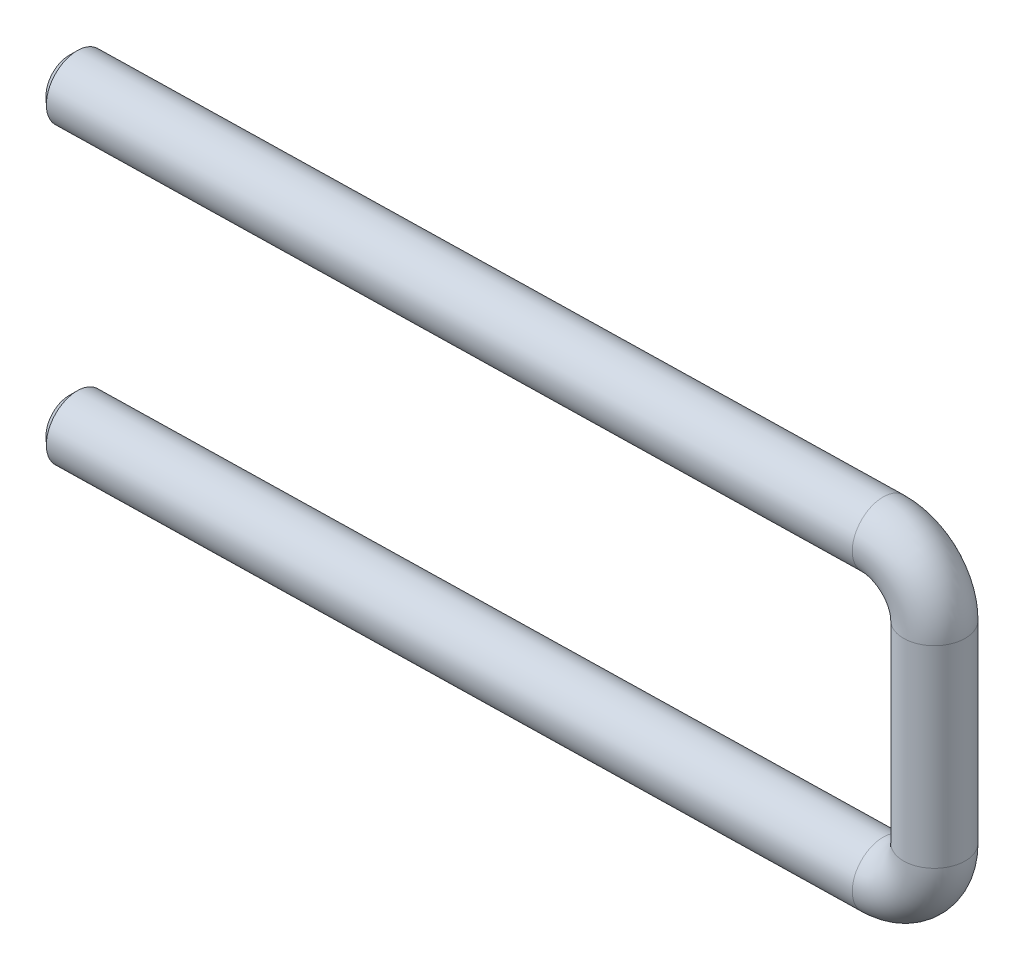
ISO-10303-21;
HEADER;
FILE_DESCRIPTION(('STEP AP214'),'2;1');
FILE_NAME('part.step','',(''),(''),'','','');
FILE_SCHEMA(('AUTOMOTIVE_DESIGN { 1 0 10303 214 1 1 1 1 }'));
ENDSEC;
DATA;
#1=APPLICATION_CONTEXT('core data for automotive mechanical design processes');
#2=APPLICATION_PROTOCOL_DEFINITION('international standard','automotive_design',2000,#1);
#3=PRODUCT_CONTEXT('',#1,'mechanical');
#4=PRODUCT('Part','Part','',(#3));
#5=PRODUCT_RELATED_PRODUCT_CATEGORY('part','',(#4));
#6=PRODUCT_DEFINITION_FORMATION('','',#4);
#7=PRODUCT_DEFINITION_CONTEXT('part definition',#1,'design');
#8=PRODUCT_DEFINITION('design','',#6,#7);
#9=PRODUCT_DEFINITION_SHAPE('','',#8);
#10=(LENGTH_UNIT() NAMED_UNIT(*) SI_UNIT(.MILLI.,.METRE.));
#11=(NAMED_UNIT(*) PLANE_ANGLE_UNIT() SI_UNIT($,.RADIAN.));
#12=(NAMED_UNIT(*) SI_UNIT($,.STERADIAN.) SOLID_ANGLE_UNIT());
#13=UNCERTAINTY_MEASURE_WITH_UNIT(LENGTH_MEASURE(1.E-05),#10,'distance_accuracy_value','');
#14=(GEOMETRIC_REPRESENTATION_CONTEXT(3) GLOBAL_UNCERTAINTY_ASSIGNED_CONTEXT((#13)) GLOBAL_UNIT_ASSIGNED_CONTEXT((#10,
#11,#12)) REPRESENTATION_CONTEXT('',''));
#15=CARTESIAN_POINT('',(0.,0.,0.));
#16=DIRECTION('',(0.,0.,1.));
#17=DIRECTION('',(1.,0.,0.));
#18=AXIS2_PLACEMENT_3D('',#15,#16,#17);
#19=CARTESIAN_POINT('',(-54.9881774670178,-9.55,1.14032401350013));
#20=DIRECTION('',(-0.999785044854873,0.,0.0207331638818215));
#21=DIRECTION('',(0.,1.,0.));
#22=AXIS2_PLACEMENT_3D('',#19,#20,#21);
#23=PLANE('',#22);
#24=CARTESIAN_POINT('',(-54.9881774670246,-9.55,1.14032401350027));
#25=DIRECTION('',(0.999785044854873,0.,-0.0207331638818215));
#26=DIRECTION('',(0.,-1.,0.));
#27=AXIS2_PLACEMENT_3D('',#24,#25,#26);
#28=CIRCLE('',#27,1.49999999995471);
#29=CARTESIAN_POINT('',(-54.9881774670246,-11.0499999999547,1.14032401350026));
#30=VERTEX_POINT('',#29);
#31=EDGE_CURVE('E15',#30,#30,#28,.T.);
#32=ORIENTED_EDGE('',*,*,#31,.F.);
#33=EDGE_LOOP('',(#32));
#34=FACE_BOUND('',#33,.T.);
#35=ADVANCED_FACE('F12',(#34),#23,.T.);
#36=CARTESIAN_POINT('',(-54.4882849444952,-9.55,1.12995743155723));
#37=DIRECTION('',(0.999785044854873,0.,-0.0207331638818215));
#38=DIRECTION('',(0.,-1.,0.));
#39=AXIS2_PLACEMENT_3D('',#36,#37,#38);
#40=CONICAL_SURFACE('',#39,2.00000000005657,0.785398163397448);
#41=CARTESIAN_POINT('',(-54.4882849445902,-9.55,1.12995743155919));
#42=DIRECTION('',(-0.999785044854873,0.,0.0207331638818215));
#43=DIRECTION('',(0.,1.,0.));
#44=AXIS2_PLACEMENT_3D('',#41,#42,#43);
#45=CIRCLE('',#44,2.);
#46=CARTESIAN_POINT('',(-54.4882849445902,-7.55,1.1299574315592));
#47=VERTEX_POINT('',#46);
#48=EDGE_CURVE('E59',#47,#47,#45,.F.);
#49=ORIENTED_EDGE('',*,*,#48,.F.);
#50=EDGE_LOOP('',(#49));
#51=FACE_BOUND('',#50,.T.);
#52=ORIENTED_EDGE('',*,*,#31,.T.);
#53=EDGE_LOOP('',(#52));
#54=FACE_BOUND('',#53,.T.);
#55=ADVANCED_FACE('F114',(#51,#54),#40,.T.);
#56=CARTESIAN_POINT('',(-3.29929064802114,-9.55,0.0684194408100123));
#57=DIRECTION('',(-0.999785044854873,0.,0.0207331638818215));
#58=DIRECTION('',(0.,1.,0.));
#59=AXIS2_PLACEMENT_3D('',#56,#57,#58);
#60=CYLINDRICAL_SURFACE('',#59,2.);
#61=ORIENTED_EDGE('',*,*,#48,.T.);
#62=EDGE_LOOP('',(#61));
#63=FACE_BOUND('',#62,.T.);
#64=CARTESIAN_POINT('',(-3.29929064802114,-9.55,0.0684194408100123));
#65=DIRECTION('',(-0.999785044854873,0.,0.0207331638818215));
#66=DIRECTION('',(0.,-1.,0.));
#67=AXIS2_PLACEMENT_3D('',#64,#65,#66);
#68=CIRCLE('',#67,2.);
#69=CARTESIAN_POINT('',(-3.29929064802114,-11.55,0.0684194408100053));
#70=VERTEX_POINT('',#69);
#71=EDGE_CURVE('E56',#70,#70,#68,.F.);
#72=ORIENTED_EDGE('',*,*,#71,.F.);
#73=EDGE_LOOP('',(#72));
#74=FACE_BOUND('',#73,.T.);
#75=ADVANCED_FACE('F51',(#63,#74),#60,.T.);
#76=CARTESIAN_POINT('',(-3.29929064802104,-6.25,0.0684194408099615));
#77=DIRECTION('',(-0.0207331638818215,0.,-0.999785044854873));
#78=DIRECTION('',(0.999785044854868,0.,-0.0207331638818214));
#79=AXIS2_PLACEMENT_3D('',#76,#77,#78);
#80=TOROIDAL_SURFACE('',#79,3.30000000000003,2.);
#81=ORIENTED_EDGE('',*,*,#71,.T.);
#82=EDGE_LOOP('',(#81));
#83=FACE_BOUND('',#82,.T.);
#84=CARTESIAN_POINT('',(0.,-6.25,0.));
#85=DIRECTION('',(0.,-1.,0.));
#86=DIRECTION('',(-0.999785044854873,0.,0.0207331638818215));
#87=AXIS2_PLACEMENT_3D('',#84,#85,#86);
#88=CIRCLE('',#87,2.);
#89=CARTESIAN_POINT('',(-1.99957008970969,-6.25,0.0414663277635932));
#90=VERTEX_POINT('',#89);
#91=EDGE_CURVE('E55',#90,#90,#88,.F.);
#92=ORIENTED_EDGE('',*,*,#91,.F.);
#93=EDGE_LOOP('',(#92));
#94=FACE_BOUND('',#93,.T.);
#95=ADVANCED_FACE('F46',(#83,#94),#80,.T.);
#96=CARTESIAN_POINT('',(0.,6.25000000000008,0.));
#97=DIRECTION('',(0.,-1.,0.));
#98=DIRECTION('',(-0.999785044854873,0.,0.0207331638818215));
#99=AXIS2_PLACEMENT_3D('',#96,#97,#98);
#100=CYLINDRICAL_SURFACE('',#99,2.);
#101=ORIENTED_EDGE('',*,*,#91,.T.);
#102=EDGE_LOOP('',(#101));
#103=FACE_BOUND('',#102,.T.);
#104=CARTESIAN_POINT('',(0.,6.25000000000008,0.));
#105=DIRECTION('',(0.,-1.,0.));
#106=DIRECTION('',(0.999785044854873,0.,-0.0207331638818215));
#107=AXIS2_PLACEMENT_3D('',#104,#105,#106);
#108=CIRCLE('',#107,2.);
#109=CARTESIAN_POINT('',(1.99957008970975,6.25000000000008,-0.0414663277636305));
#110=VERTEX_POINT('',#109);
#111=EDGE_CURVE('E29',#110,#110,#108,.F.);
#112=ORIENTED_EDGE('',*,*,#111,.F.);
#113=EDGE_LOOP('',(#112));
#114=FACE_BOUND('',#113,.T.);
#115=ADVANCED_FACE('F42',(#103,#114),#100,.T.);
#116=CARTESIAN_POINT('',(-54.9881774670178,9.55,1.14032401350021));
#117=DIRECTION('',(0.999785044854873,0.,-0.0207331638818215));
#118=DIRECTION('',(0.,-1.,0.));
#119=AXIS2_PLACEMENT_3D('',#116,#117,#118);
#120=PLANE('',#119);
#121=CARTESIAN_POINT('',(-54.9881774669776,9.55,1.14032401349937));
#122=DIRECTION('',(0.999785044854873,0.,-0.0207331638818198));
#123=DIRECTION('',(0.0207331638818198,0.,0.999785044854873));
#124=AXIS2_PLACEMENT_3D('',#121,#122,#123);
#125=CIRCLE('',#124,1.49999999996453);
#126=CARTESIAN_POINT('',(-54.9570777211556,9.54999999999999,2.64000158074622));
#127=VERTEX_POINT('',#126);
#128=EDGE_CURVE('E24',#127,#127,#125,.T.);
#129=ORIENTED_EDGE('',*,*,#128,.F.);
#130=EDGE_LOOP('',(#129));
#131=FACE_BOUND('',#130,.T.);
#132=ADVANCED_FACE('F37',(#131),#120,.F.);
#133=CARTESIAN_POINT('',(-3.29929064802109,6.25,0.068419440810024));
#134=DIRECTION('',(-0.0207331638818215,0.,-0.999785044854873));
#135=DIRECTION('',(0.999785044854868,0.,-0.0207331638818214));
#136=AXIS2_PLACEMENT_3D('',#133,#134,#135);
#137=TOROIDAL_SURFACE('',#136,3.30000000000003,2.);
#138=ORIENTED_EDGE('',*,*,#111,.T.);
#139=EDGE_LOOP('',(#138));
#140=FACE_BOUND('',#139,.T.);
#141=CARTESIAN_POINT('',(-3.29929064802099,9.55,0.0684194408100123));
#142=DIRECTION('',(-0.999785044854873,0.,0.0207331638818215));
#143=DIRECTION('',(0.,1.,0.));
#144=AXIS2_PLACEMENT_3D('',#141,#142,#143);
#145=CIRCLE('',#144,2.);
#146=CARTESIAN_POINT('',(-3.29929064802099,11.55,0.0684194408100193));
#147=VERTEX_POINT('',#146);
#148=EDGE_CURVE('E19',#147,#147,#145,.T.);
#149=ORIENTED_EDGE('',*,*,#148,.F.);
#150=EDGE_LOOP('',(#149));
#151=FACE_BOUND('',#150,.T.);
#152=ADVANCED_FACE('F32',(#140,#151),#137,.T.);
#153=CARTESIAN_POINT('',(-54.4882849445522,9.55,1.12995743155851));
#154=DIRECTION('',(0.999785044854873,0.,-0.0207331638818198));
#155=DIRECTION('',(0.0207331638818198,0.,0.999785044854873));
#156=AXIS2_PLACEMENT_3D('',#153,#154,#155);
#157=CONICAL_SURFACE('',#156,2.00000000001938,0.785398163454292);
#158=CARTESIAN_POINT('',(-54.4882849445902,9.55,1.12995743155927));
#159=DIRECTION('',(-0.999785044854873,0.,0.0207331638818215));
#160=DIRECTION('',(0.,1.,0.));
#161=AXIS2_PLACEMENT_3D('',#158,#159,#160);
#162=CIRCLE('',#161,2.);
#163=CARTESIAN_POINT('',(-54.4882849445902,11.55,1.12995743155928));
#164=VERTEX_POINT('',#163);
#165=EDGE_CURVE('E8',#164,#164,#162,.F.);
#166=ORIENTED_EDGE('',*,*,#165,.F.);
#167=EDGE_LOOP('',(#166));
#168=FACE_BOUND('',#167,.T.);
#169=ORIENTED_EDGE('',*,*,#128,.T.);
#170=EDGE_LOOP('',(#169));
#171=FACE_BOUND('',#170,.T.);
#172=ADVANCED_FACE('F36',(#168,#171),#157,.T.);
#173=CARTESIAN_POINT('',(-3.29929064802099,9.55,0.0684194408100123));
#174=DIRECTION('',(-0.999785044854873,0.,0.0207331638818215));
#175=DIRECTION('',(0.,1.,0.));
#176=AXIS2_PLACEMENT_3D('',#173,#174,#175);
#177=CYLINDRICAL_SURFACE('',#176,2.);
#178=ORIENTED_EDGE('',*,*,#165,.T.);
#179=EDGE_LOOP('',(#178));
#180=FACE_BOUND('',#179,.T.);
#181=ORIENTED_EDGE('',*,*,#148,.T.);
#182=EDGE_LOOP('',(#181));
#183=FACE_BOUND('',#182,.T.);
#184=ADVANCED_FACE('F73',(#180,#183),#177,.T.);
#185=CLOSED_SHELL('',(#35,#55,#75,#95,#115,#132,#152,#172,#184));
#186=MANIFOLD_SOLID_BREP('B1',#185);
#187=ADVANCED_BREP_SHAPE_REPRESENTATION('',(#18,#186),#14);
#188=SHAPE_DEFINITION_REPRESENTATION(#9,#187);
ENDSEC;
END-ISO-10303-21;
